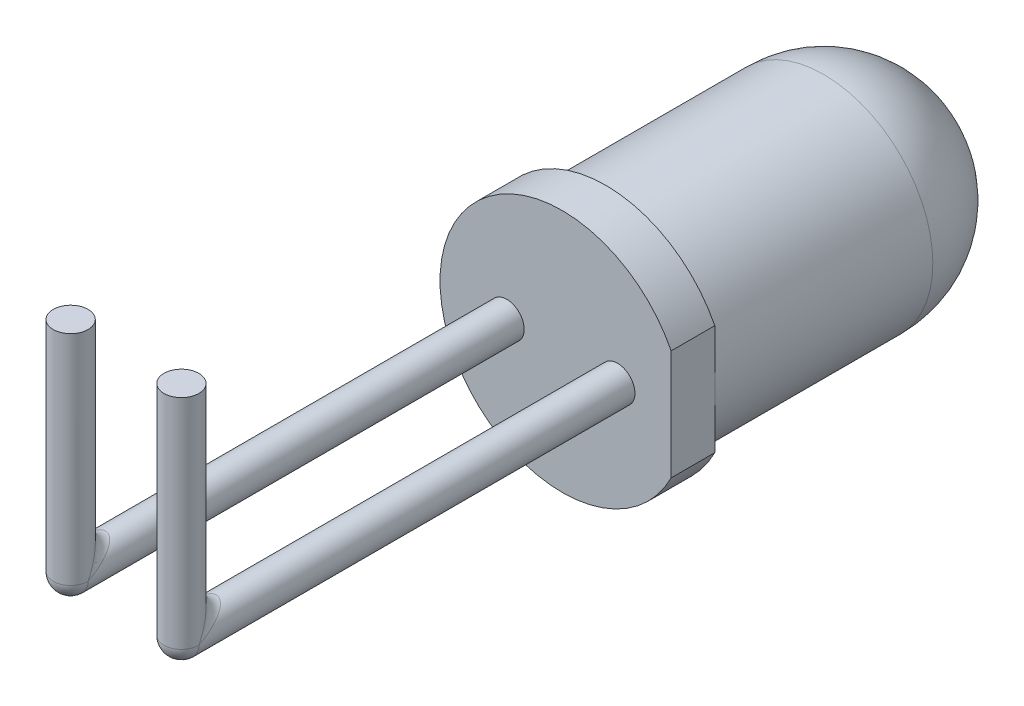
ISO-10303-21;
HEADER;
FILE_DESCRIPTION(('STEP AP214'),'2;1');
FILE_NAME('part.step','',(''),(''),'','','');
FILE_SCHEMA(('AUTOMOTIVE_DESIGN { 1 0 10303 214 1 1 1 1 }'));
ENDSEC;
DATA;
#1=APPLICATION_CONTEXT('core data for automotive mechanical design processes');
#2=APPLICATION_PROTOCOL_DEFINITION('international standard','automotive_design',2000,#1);
#3=PRODUCT_CONTEXT('',#1,'mechanical');
#4=PRODUCT('Part','Part','',(#3));
#5=PRODUCT_RELATED_PRODUCT_CATEGORY('part','',(#4));
#6=PRODUCT_DEFINITION_FORMATION('','',#4);
#7=PRODUCT_DEFINITION_CONTEXT('part definition',#1,'design');
#8=PRODUCT_DEFINITION('design','',#6,#7);
#9=PRODUCT_DEFINITION_SHAPE('','',#8);
#10=(LENGTH_UNIT() NAMED_UNIT(*) SI_UNIT(.MILLI.,.METRE.));
#11=(NAMED_UNIT(*) PLANE_ANGLE_UNIT() SI_UNIT($,.RADIAN.));
#12=(NAMED_UNIT(*) SI_UNIT($,.STERADIAN.) SOLID_ANGLE_UNIT());
#13=UNCERTAINTY_MEASURE_WITH_UNIT(LENGTH_MEASURE(1.E-05),#10,'distance_accuracy_value','');
#14=(GEOMETRIC_REPRESENTATION_CONTEXT(3) GLOBAL_UNCERTAINTY_ASSIGNED_CONTEXT((#13)) GLOBAL_UNIT_ASSIGNED_CONTEXT((#10,
#11,#12)) REPRESENTATION_CONTEXT('',''));
#15=CARTESIAN_POINT('',(0.,0.,0.));
#16=DIRECTION('',(0.,0.,1.));
#17=DIRECTION('',(1.,0.,0.));
#18=AXIS2_PLACEMENT_3D('',#15,#16,#17);
#19=CARTESIAN_POINT('',(0.,0.,8.5));
#20=DIRECTION('',(0.,0.,-1.));
#21=DIRECTION('',(-1.,0.,0.));
#22=AXIS2_PLACEMENT_3D('',#19,#20,#21);
#23=CYLINDRICAL_SURFACE('',#22,2.5);
#24=CARTESIAN_POINT('',(0.,0.,2.5));
#25=DIRECTION('',(0.,0.,-1.));
#26=DIRECTION('',(-1.,0.,0.));
#27=AXIS2_PLACEMENT_3D('',#24,#25,#26);
#28=CIRCLE('',#27,2.5);
#29=CARTESIAN_POINT('',(-2.5,0.,2.5));
#30=VERTEX_POINT('',#29);
#31=EDGE_CURVE('E99',#30,#30,#28,.F.);
#32=ORIENTED_EDGE('',*,*,#31,.T.);
#33=EDGE_LOOP('',(#32));
#34=FACE_BOUND('',#33,.T.);
#35=CARTESIAN_POINT('',(0.,0.,7.5));
#36=DIRECTION('',(0.,0.,1.));
#37=DIRECTION('',(1.,0.,0.));
#38=AXIS2_PLACEMENT_3D('',#35,#36,#37);
#39=CIRCLE('',#38,2.5);
#40=CARTESIAN_POINT('',(2.5,0.,7.5));
#41=VERTEX_POINT('',#40);
#42=EDGE_CURVE('E95',#41,#41,#39,.T.);
#43=ORIENTED_EDGE('',*,*,#42,.F.);
#44=EDGE_LOOP('',(#43));
#45=FACE_BOUND('',#44,.T.);
#46=ADVANCED_FACE('F28',(#34,#45),#23,.T.);
#47=CARTESIAN_POINT('',(0.,0.,7.5));
#48=DIRECTION('',(0.,0.,1.));
#49=DIRECTION('',(1.,0.,0.));
#50=AXIS2_PLACEMENT_3D('',#47,#48,#49);
#51=PLANE('',#50);
#52=DIRECTION('',(0.,1.,0.));
#53=VECTOR('',#52,1.);
#54=CARTESIAN_POINT('',(2.5,1.26095202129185,7.5));
#55=LINE('',#54,#53);
#56=CARTESIAN_POINT('',(2.5,1.26095202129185,7.5));
#57=VERTEX_POINT('',#56);
#58=EDGE_CURVE('E90',#41,#57,#55,.T.);
#59=ORIENTED_EDGE('',*,*,#58,.F.);
#60=ORIENTED_EDGE('',*,*,#42,.T.);
#61=CARTESIAN_POINT('',(2.5,-1.26095202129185,7.5));
#62=VERTEX_POINT('',#61);
#63=EDGE_CURVE('E80',#62,#41,#55,.T.);
#64=ORIENTED_EDGE('',*,*,#63,.F.);
#65=CARTESIAN_POINT('',(0.,0.,7.5));
#66=DIRECTION('',(0.,0.,1.));
#67=DIRECTION('',(1.,0.,0.));
#68=AXIS2_PLACEMENT_3D('',#65,#66,#67);
#69=CIRCLE('',#68,2.8);
#70=EDGE_CURVE('E74',#57,#62,#69,.T.);
#71=ORIENTED_EDGE('',*,*,#70,.F.);
#72=EDGE_LOOP('',(#59,#60,#64,#71));
#73=FACE_BOUND('',#72,.T.);
#74=ADVANCED_FACE('F140',(#73),#51,.F.);
#75=CARTESIAN_POINT('',(2.5,1.26095202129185,7.5));
#76=DIRECTION('',(1.,0.,0.));
#77=DIRECTION('',(0.,0.,-1.));
#78=AXIS2_PLACEMENT_3D('',#75,#76,#77);
#79=PLANE('',#78);
#80=ORIENTED_EDGE('',*,*,#63,.T.);
#81=ORIENTED_EDGE('',*,*,#58,.T.);
#82=DIRECTION('',(0.,0.,1.));
#83=VECTOR('',#82,1.);
#84=CARTESIAN_POINT('',(2.5,1.26095202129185,7.5));
#85=LINE('',#84,#83);
#86=CARTESIAN_POINT('',(2.5,1.26095202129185,8.5));
#87=VERTEX_POINT('',#86);
#88=EDGE_CURVE('E79',#57,#87,#85,.T.);
#89=ORIENTED_EDGE('',*,*,#88,.T.);
#90=DIRECTION('',(0.,1.,0.));
#91=VECTOR('',#90,1.);
#92=CARTESIAN_POINT('',(2.5,1.26095202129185,8.5));
#93=LINE('',#92,#91);
#94=CARTESIAN_POINT('',(2.5,-1.26095202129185,8.5));
#95=VERTEX_POINT('',#94);
#96=EDGE_CURVE('E84',#95,#87,#93,.T.);
#97=ORIENTED_EDGE('',*,*,#96,.F.);
#98=DIRECTION('',(0.,0.,1.));
#99=VECTOR('',#98,1.);
#100=CARTESIAN_POINT('',(2.5,-1.26095202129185,7.5));
#101=LINE('',#100,#99);
#102=EDGE_CURVE('E68',#62,#95,#101,.T.);
#103=ORIENTED_EDGE('',*,*,#102,.F.);
#104=EDGE_LOOP('',(#80,#81,#89,#97,#103));
#105=FACE_BOUND('',#104,.T.);
#106=ADVANCED_FACE('F88',(#105),#79,.T.);
#107=CARTESIAN_POINT('',(0.,0.,7.5));
#108=DIRECTION('',(0.,0.,1.));
#109=DIRECTION('',(1.,0.,0.));
#110=AXIS2_PLACEMENT_3D('',#107,#108,#109);
#111=CYLINDRICAL_SURFACE('',#110,2.8);
#112=CARTESIAN_POINT('',(0.,0.,8.5));
#113=DIRECTION('',(0.,0.,1.));
#114=DIRECTION('',(1.,0.,0.));
#115=AXIS2_PLACEMENT_3D('',#112,#113,#114);
#116=CIRCLE('',#115,2.8);
#117=EDGE_CURVE('E72',#87,#95,#116,.T.);
#118=ORIENTED_EDGE('',*,*,#117,.F.);
#119=ORIENTED_EDGE('',*,*,#88,.F.);
#120=ORIENTED_EDGE('',*,*,#70,.T.);
#121=ORIENTED_EDGE('',*,*,#102,.T.);
#122=EDGE_LOOP('',(#118,#119,#120,#121));
#123=FACE_BOUND('',#122,.T.);
#124=ADVANCED_FACE('F70',(#123),#111,.T.);
#125=CARTESIAN_POINT('',(0.,0.,8.5));
#126=DIRECTION('',(0.,0.,1.));
#127=DIRECTION('',(1.,0.,0.));
#128=AXIS2_PLACEMENT_3D('',#125,#126,#127);
#129=PLANE('',#128);
#130=CARTESIAN_POINT('',(-1.27,0.,8.5));
#131=DIRECTION('',(0.,0.,1.));
#132=DIRECTION('',(1.,0.,0.));
#133=AXIS2_PLACEMENT_3D('',#130,#131,#132);
#134=CIRCLE('',#133,0.4);
#135=CARTESIAN_POINT('',(-0.87,0.,8.5));
#136=VERTEX_POINT('',#135);
#137=EDGE_CURVE('E107',#136,#136,#134,.T.);
#138=ORIENTED_EDGE('',*,*,#137,.F.);
#139=EDGE_LOOP('',(#138));
#140=FACE_BOUND('',#139,.T.);
#141=CARTESIAN_POINT('',(1.27,0.,8.5));
#142=DIRECTION('',(0.,0.,1.));
#143=DIRECTION('',(1.,0.,0.));
#144=AXIS2_PLACEMENT_3D('',#141,#142,#143);
#145=CIRCLE('',#144,0.4);
#146=CARTESIAN_POINT('',(1.67,0.,8.5));
#147=VERTEX_POINT('',#146);
#148=EDGE_CURVE('E102',#147,#147,#145,.T.);
#149=ORIENTED_EDGE('',*,*,#148,.F.);
#150=EDGE_LOOP('',(#149));
#151=FACE_BOUND('',#150,.T.);
#152=ORIENTED_EDGE('',*,*,#96,.T.);
#153=ORIENTED_EDGE('',*,*,#117,.T.);
#154=EDGE_LOOP('',(#152,#153));
#155=FACE_BOUND('',#154,.T.);
#156=ADVANCED_FACE('F83',(#140,#151,#155),#129,.T.);
#157=CARTESIAN_POINT('',(0.,0.,2.5));
#158=DIRECTION('',(0.,0.,1.));
#159=DIRECTION('',(1.,0.,0.));
#160=AXIS2_PLACEMENT_3D('',#157,#158,#159);
#161=SPHERICAL_SURFACE('',#160,2.5);
#162=ORIENTED_EDGE('',*,*,#31,.F.);
#163=EDGE_LOOP('',(#162));
#164=FACE_BOUND('',#163,.T.);
#165=ADVANCED_FACE('F153',(#164),#161,.T.);
#166=CARTESIAN_POINT('',(1.27,0.,18.5));
#167=DIRECTION('',(0.,1.,0.));
#168=DIRECTION('',(0.,0.,1.));
#169=AXIS2_PLACEMENT_3D('',#166,#167,#168);
#170=CYLINDRICAL_SURFACE('',#169,0.4);
#171=CARTESIAN_POINT('',(1.27,0.,18.5));
#172=DIRECTION('',(0.,-0.447213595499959,-0.894427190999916));
#173=DIRECTION('',(0.,0.894427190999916,-0.447213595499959));
#174=AXIS2_PLACEMENT_3D('',#171,#172,#173);
#175=ELLIPSE('',#174,0.894427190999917,0.4);
#176=CARTESIAN_POINT('',(1.67,0.,18.5));
#177=VERTEX_POINT('',#176);
#178=CARTESIAN_POINT('',(0.87,0.,18.5));
#179=VERTEX_POINT('',#178);
#180=EDGE_CURVE('E103',#177,#179,#175,.F.);
#181=ORIENTED_EDGE('',*,*,#180,.T.);
#182=CARTESIAN_POINT('',(1.27,0.,18.5));
#183=DIRECTION('',(0.,1.,0.));
#184=DIRECTION('',(0.,0.,1.));
#185=AXIS2_PLACEMENT_3D('',#182,#183,#184);
#186=CIRCLE('',#185,0.4);
#187=EDGE_CURVE('E106',#179,#177,#186,.T.);
#188=ORIENTED_EDGE('',*,*,#187,.T.);
#189=EDGE_LOOP('',(#181,#188));
#190=FACE_BOUND('',#189,.T.);
#191=CARTESIAN_POINT('',(1.27,5.,18.5));
#192=DIRECTION('',(0.,1.,0.));
#193=DIRECTION('',(0.,0.,1.));
#194=AXIS2_PLACEMENT_3D('',#191,#192,#193);
#195=CIRCLE('',#194,0.4);
#196=CARTESIAN_POINT('',(1.27,5.,18.9));
#197=VERTEX_POINT('',#196);
#198=EDGE_CURVE('E86',#197,#197,#195,.F.);
#199=ORIENTED_EDGE('',*,*,#198,.T.);
#200=EDGE_LOOP('',(#199));
#201=FACE_BOUND('',#200,.T.);
#202=ADVANCED_FACE('F154',(#190,#201),#170,.T.);
#203=CARTESIAN_POINT('',(1.27,0.,19.6313708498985));
#204=DIRECTION('',(0.,0.,-1.));
#205=DIRECTION('',(0.,1.,0.));
#206=AXIS2_PLACEMENT_3D('',#203,#204,#205);
#207=CYLINDRICAL_SURFACE('',#206,0.4);
#208=ORIENTED_EDGE('',*,*,#148,.T.);
#209=EDGE_LOOP('',(#208));
#210=FACE_BOUND('',#209,.T.);
#211=CARTESIAN_POINT('',(1.27,0.,18.5));
#212=DIRECTION('',(0.,0.,-1.));
#213=DIRECTION('',(0.,1.,0.));
#214=AXIS2_PLACEMENT_3D('',#211,#212,#213);
#215=CIRCLE('',#214,0.4);
#216=EDGE_CURVE('E110',#177,#179,#215,.T.);
#217=ORIENTED_EDGE('',*,*,#216,.T.);
#218=CARTESIAN_POINT('',(1.27,0.,18.5));
#219=DIRECTION('',(0.,-0.894427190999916,-0.447213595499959));
#220=DIRECTION('',(0.,0.447213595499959,-0.894427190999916));
#221=AXIS2_PLACEMENT_3D('',#218,#219,#220);
#222=ELLIPSE('',#221,0.894427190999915,0.4);
#223=EDGE_CURVE('E113',#179,#177,#222,.T.);
#224=ORIENTED_EDGE('',*,*,#223,.T.);
#225=EDGE_LOOP('',(#217,#224));
#226=FACE_BOUND('',#225,.T.);
#227=ADVANCED_FACE('F160',(#210,#226),#207,.T.);
#228=CARTESIAN_POINT('',(1.27,5.,18.5));
#229=DIRECTION('',(0.,1.,0.));
#230=DIRECTION('',(0.,0.,1.));
#231=AXIS2_PLACEMENT_3D('',#228,#229,#230);
#232=PLANE('',#231);
#233=ORIENTED_EDGE('',*,*,#198,.F.);
#234=EDGE_LOOP('',(#233));
#235=FACE_BOUND('',#234,.T.);
#236=ADVANCED_FACE('F203',(#235),#232,.T.);
#237=CARTESIAN_POINT('',(-1.27,0.,18.5));
#238=DIRECTION('',(0.,1.,0.));
#239=DIRECTION('',(0.,0.,1.));
#240=AXIS2_PLACEMENT_3D('',#237,#238,#239);
#241=CYLINDRICAL_SURFACE('',#240,0.4);
#242=CARTESIAN_POINT('',(-1.27,0.,18.5));
#243=DIRECTION('',(0.,-0.447213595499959,-0.894427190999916));
#244=DIRECTION('',(0.,0.894427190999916,-0.447213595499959));
#245=AXIS2_PLACEMENT_3D('',#242,#243,#244);
#246=ELLIPSE('',#245,0.894427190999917,0.4);
#247=CARTESIAN_POINT('',(-0.87,0.,18.5));
#248=VERTEX_POINT('',#247);
#249=CARTESIAN_POINT('',(-1.67,0.,18.5));
#250=VERTEX_POINT('',#249);
#251=EDGE_CURVE('E116',#248,#250,#246,.F.);
#252=ORIENTED_EDGE('',*,*,#251,.T.);
#253=CARTESIAN_POINT('',(-1.27,0.,18.5));
#254=DIRECTION('',(0.,1.,0.));
#255=DIRECTION('',(0.,0.,1.));
#256=AXIS2_PLACEMENT_3D('',#253,#254,#255);
#257=CIRCLE('',#256,0.4);
#258=EDGE_CURVE('E119',#250,#248,#257,.T.);
#259=ORIENTED_EDGE('',*,*,#258,.T.);
#260=EDGE_LOOP('',(#252,#259));
#261=FACE_BOUND('',#260,.T.);
#262=CARTESIAN_POINT('',(-1.27,5.,18.5));
#263=DIRECTION('',(0.,1.,0.));
#264=DIRECTION('',(0.,0.,1.));
#265=AXIS2_PLACEMENT_3D('',#262,#263,#264);
#266=CIRCLE('',#265,0.4);
#267=CARTESIAN_POINT('',(-1.27,5.,18.9));
#268=VERTEX_POINT('',#267);
#269=EDGE_CURVE('E262',#268,#268,#266,.F.);
#270=ORIENTED_EDGE('',*,*,#269,.T.);
#271=EDGE_LOOP('',(#270));
#272=FACE_BOUND('',#271,.T.);
#273=ADVANCED_FACE('F124',(#261,#272),#241,.T.);
#274=CARTESIAN_POINT('',(-1.27,0.,19.6313708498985));
#275=DIRECTION('',(0.,0.,-1.));
#276=DIRECTION('',(0.,1.,0.));
#277=AXIS2_PLACEMENT_3D('',#274,#275,#276);
#278=CYLINDRICAL_SURFACE('',#277,0.4);
#279=ORIENTED_EDGE('',*,*,#137,.T.);
#280=EDGE_LOOP('',(#279));
#281=FACE_BOUND('',#280,.T.);
#282=CARTESIAN_POINT('',(-1.27,0.,18.5));
#283=DIRECTION('',(0.,0.,-1.));
#284=DIRECTION('',(0.,1.,0.));
#285=AXIS2_PLACEMENT_3D('',#282,#283,#284);
#286=CIRCLE('',#285,0.4);
#287=EDGE_CURVE('E35',#248,#250,#286,.T.);
#288=ORIENTED_EDGE('',*,*,#287,.T.);
#289=CARTESIAN_POINT('',(-1.27,0.,18.5));
#290=DIRECTION('',(0.,-0.894427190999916,-0.447213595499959));
#291=DIRECTION('',(0.,0.447213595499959,-0.894427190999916));
#292=AXIS2_PLACEMENT_3D('',#289,#290,#291);
#293=ELLIPSE('',#292,0.894427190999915,0.4);
#294=EDGE_CURVE('E12',#250,#248,#293,.T.);
#295=ORIENTED_EDGE('',*,*,#294,.T.);
#296=EDGE_LOOP('',(#288,#295));
#297=FACE_BOUND('',#296,.T.);
#298=ADVANCED_FACE('F122',(#281,#297),#278,.T.);
#299=CARTESIAN_POINT('',(-1.27,5.,18.5));
#300=DIRECTION('',(0.,1.,0.));
#301=DIRECTION('',(0.,0.,1.));
#302=AXIS2_PLACEMENT_3D('',#299,#300,#301);
#303=PLANE('',#302);
#304=ORIENTED_EDGE('',*,*,#269,.F.);
#305=EDGE_LOOP('',(#304));
#306=FACE_BOUND('',#305,.T.);
#307=ADVANCED_FACE('F222',(#306),#303,.T.);
#308=CARTESIAN_POINT('',(1.27,0.,18.5));
#309=DIRECTION('',(0.,0.,1.));
#310=DIRECTION('',(1.,0.,0.));
#311=AXIS2_PLACEMENT_3D('',#308,#309,#310);
#312=SPHERICAL_SURFACE('',#311,0.4);
#313=ORIENTED_EDGE('',*,*,#187,.F.);
#314=ORIENTED_EDGE('',*,*,#216,.F.);
#315=EDGE_LOOP('',(#313,#314));
#316=FACE_BOUND('',#315,.T.);
#317=ADVANCED_FACE('F136',(#316),#312,.T.);
#318=CARTESIAN_POINT('',(1.67,0.,18.5));
#319=CARTESIAN_POINT('',(1.67,0.,18.5));
#320=CARTESIAN_POINT('',(1.67,0.,18.5));
#321=CARTESIAN_POINT('',(1.66999298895,0.0348517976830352,18.4825741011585));
#322=CARTESIAN_POINT('',(1.67005108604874,0.0261441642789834,18.473855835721));
#323=CARTESIAN_POINT('',(1.66999298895,0.0174258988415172,18.465148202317));
#324=CARTESIAN_POINT('',(1.66886070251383,0.0697124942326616,18.4651437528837));
#325=CARTESIAN_POINT('',(1.66772093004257,0.0523600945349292,18.4476399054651));
#326=CARTESIAN_POINT('',(1.66886070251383,0.0348562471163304,18.4302875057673));
#327=CARTESIAN_POINT('',(1.66431458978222,0.138834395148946,18.4305828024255));
#328=CARTESIAN_POINT('',(1.65863330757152,0.103749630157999,18.396250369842));
#329=CARTESIAN_POINT('',(1.66431458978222,0.0694171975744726,18.3611656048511));
#330=CARTESIAN_POINT('',(1.66092023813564,0.173098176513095,18.4134509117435));
#331=CARTESIAN_POINT('',(1.65186272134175,0.129071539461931,18.3709284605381));
#332=CARTESIAN_POINT('',(1.66092023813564,0.0865490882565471,18.3269018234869));
#333=CARTESIAN_POINT('',(1.65189673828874,0.24044273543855,18.3797786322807));
#334=CARTESIAN_POINT('',(1.63414910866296,0.177786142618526,18.3222138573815));
#335=CARTESIAN_POINT('',(1.65189673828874,0.120221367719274,18.2595572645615));
#336=CARTESIAN_POINT('',(1.6463060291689,0.273533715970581,18.3632331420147));
#337=CARTESIAN_POINT('',(1.62318021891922,0.201325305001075,18.2986746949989));
#338=CARTESIAN_POINT('',(1.6463060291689,0.13676685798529,18.2264662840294));
#339=CARTESIAN_POINT('',(1.63296398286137,0.337956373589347,18.3310218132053));
#340=CARTESIAN_POINT('',(1.59763412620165,0.245616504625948,18.2543834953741));
#341=CARTESIAN_POINT('',(1.63296398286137,0.168978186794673,18.1620436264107));
#342=CARTESIAN_POINT('',(1.62526926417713,0.369311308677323,18.3153443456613));
#343=CARTESIAN_POINT('',(1.58301825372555,0.266510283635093,18.2334897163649));
#344=CARTESIAN_POINT('',(1.62526926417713,0.184655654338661,18.1306886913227));
#345=CARTESIAN_POINT('',(1.60783304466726,0.429711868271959,18.285144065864));
#346=CARTESIAN_POINT('',(1.55100028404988,0.304712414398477,18.1952875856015));
#347=CARTESIAN_POINT('',(1.60783304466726,0.214855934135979,18.070288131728));
#348=CARTESIAN_POINT('',(1.59816448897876,0.458799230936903,18.2706003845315));
#349=CARTESIAN_POINT('',(1.53354818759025,0.32215419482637,18.1778458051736));
#350=CARTESIAN_POINT('',(1.59816448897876,0.229399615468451,18.0412007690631));
#351=CARTESIAN_POINT('',(1.57692939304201,0.514147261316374,18.2429263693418));
#352=CARTESIAN_POINT('',(1.49701863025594,0.352779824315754,18.1472201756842));
#353=CARTESIAN_POINT('',(1.57692939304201,0.257073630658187,17.9858527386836));
#354=CARTESIAN_POINT('',(1.56544892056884,0.540473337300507,18.2297633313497));
#355=CARTESIAN_POINT('',(1.47788315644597,0.366083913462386,18.1339160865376));
#356=CARTESIAN_POINT('',(1.56544892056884,0.270236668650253,17.9595266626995));
#357=CARTESIAN_POINT('',(1.54077355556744,0.589823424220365,18.2050882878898));
#358=CARTESIAN_POINT('',(1.43951787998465,0.388004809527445,18.1119951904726));
#359=CARTESIAN_POINT('',(1.54077355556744,0.294911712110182,17.9101765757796));
#360=CARTESIAN_POINT('',(1.52767253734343,0.612940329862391,18.1935298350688));
#361=CARTESIAN_POINT('',(1.42022816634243,0.396723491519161,18.1032765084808));
#362=CARTESIAN_POINT('',(1.52767253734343,0.306470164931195,17.8870596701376));
#363=CARTESIAN_POINT('',(1.49997342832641,0.655447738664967,18.1722761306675));
#364=CARTESIAN_POINT('',(1.38341468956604,0.409472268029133,18.0905277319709));
#365=CARTESIAN_POINT('',(1.49997342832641,0.327723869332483,17.844552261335));
#366=CARTESIAN_POINT('',(1.48546909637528,0.674959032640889,18.1625204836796));
#367=CARTESIAN_POINT('',(1.36583761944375,0.413582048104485,18.0864179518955));
#368=CARTESIAN_POINT('',(1.48546909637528,0.337479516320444,17.8250409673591));
#369=CARTESIAN_POINT('',(1.45521408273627,0.709892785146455,18.1450536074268));
#370=CARTESIAN_POINT('',(1.33439698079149,0.417771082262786,18.0822289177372));
#371=CARTESIAN_POINT('',(1.45521408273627,0.354946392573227,17.7901072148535));
#372=CARTESIAN_POINT('',(1.43954673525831,0.725457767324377,18.1372711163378));
#373=CARTESIAN_POINT('',(1.32049509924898,0.417907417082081,18.0820925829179));
#374=CARTESIAN_POINT('',(1.43954673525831,0.362728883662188,17.7745422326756));
#375=CARTESIAN_POINT('',(1.40724861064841,0.752212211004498,18.1238938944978));
#376=CARTESIAN_POINT('',(1.2978686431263,0.41562409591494,18.0843759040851));
#377=CARTESIAN_POINT('',(1.40724861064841,0.376106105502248,17.7477877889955));
#378=CARTESIAN_POINT('',(1.39068005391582,0.763549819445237,18.1182250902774));
#379=CARTESIAN_POINT('',(1.28912434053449,0.413242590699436,18.0867574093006));
#380=CARTESIAN_POINT('',(1.39068005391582,0.381774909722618,17.7364501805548));
#381=CARTESIAN_POINT('',(1.35689020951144,0.781655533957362,18.1091722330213));
#382=CARTESIAN_POINT('',(1.2769352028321,0.408038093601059,18.0919619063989));
#383=CARTESIAN_POINT('',(1.35689020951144,0.390827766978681,17.7183444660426));
#384=CARTESIAN_POINT('',(1.33970345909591,0.788550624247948,18.105724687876));
#385=CARTESIAN_POINT('',(1.27348474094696,0.405239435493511,18.0947605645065));
#386=CARTESIAN_POINT('',(1.33970345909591,0.394275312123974,17.7114493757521));
#387=CARTESIAN_POINT('',(1.30500449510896,0.797685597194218,18.1011572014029));
#388=CARTESIAN_POINT('',(1.27002308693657,0.401214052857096,18.0987859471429));
#389=CARTESIAN_POINT('',(1.30500449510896,0.398842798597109,17.7023144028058));
#390=CARTESIAN_POINT('',(1.28750224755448,0.799999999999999,18.1));
#391=CARTESIAN_POINT('',(1.27001157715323,0.399999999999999,18.1));
#392=CARTESIAN_POINT('',(1.28750224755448,0.399999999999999,17.7));
#393=CARTESIAN_POINT('',(1.25249775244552,0.799999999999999,18.1));
#394=CARTESIAN_POINT('',(1.26998842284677,0.399999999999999,18.1));
#395=CARTESIAN_POINT('',(1.25249775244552,0.399999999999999,17.7));
#396=CARTESIAN_POINT('',(1.23499550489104,0.797685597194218,18.1011572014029));
#397=CARTESIAN_POINT('',(1.26997691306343,0.401214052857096,18.0987859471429));
#398=CARTESIAN_POINT('',(1.23499550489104,0.398842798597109,17.7023144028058));
#399=CARTESIAN_POINT('',(1.20029654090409,0.788550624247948,18.105724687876));
#400=CARTESIAN_POINT('',(1.26651525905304,0.405239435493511,18.0947605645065));
#401=CARTESIAN_POINT('',(1.20029654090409,0.394275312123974,17.7114493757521));
#402=CARTESIAN_POINT('',(1.18310979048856,0.781655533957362,18.1091722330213));
#403=CARTESIAN_POINT('',(1.2630647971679,0.408038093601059,18.0919619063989));
#404=CARTESIAN_POINT('',(1.18310979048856,0.390827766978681,17.7183444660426));
#405=CARTESIAN_POINT('',(1.14931994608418,0.763549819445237,18.1182250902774));
#406=CARTESIAN_POINT('',(1.25087565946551,0.413242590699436,18.0867574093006));
#407=CARTESIAN_POINT('',(1.14931994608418,0.381774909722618,17.7364501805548));
#408=CARTESIAN_POINT('',(1.13275138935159,0.752212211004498,18.1238938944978));
#409=CARTESIAN_POINT('',(1.2421313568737,0.41562409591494,18.0843759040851));
#410=CARTESIAN_POINT('',(1.13275138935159,0.376106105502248,17.7477877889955));
#411=CARTESIAN_POINT('',(1.10045326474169,0.725457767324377,18.1372711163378));
#412=CARTESIAN_POINT('',(1.21950490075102,0.417907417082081,18.0820925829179));
#413=CARTESIAN_POINT('',(1.10045326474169,0.362728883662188,17.7745422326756));
#414=CARTESIAN_POINT('',(1.08478591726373,0.709892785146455,18.1450536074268));
#415=CARTESIAN_POINT('',(1.20560301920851,0.417771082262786,18.0822289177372));
#416=CARTESIAN_POINT('',(1.08478591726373,0.354946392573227,17.7901072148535));
#417=CARTESIAN_POINT('',(1.05453090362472,0.674959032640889,18.1625204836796));
#418=CARTESIAN_POINT('',(1.17416238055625,0.413582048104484,18.0864179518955));
#419=CARTESIAN_POINT('',(1.05453090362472,0.337479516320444,17.8250409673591));
#420=CARTESIAN_POINT('',(1.04002657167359,0.655447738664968,18.1722761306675));
#421=CARTESIAN_POINT('',(1.15658531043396,0.409472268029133,18.0905277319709));
#422=CARTESIAN_POINT('',(1.04002657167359,0.327723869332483,17.844552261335));
#423=CARTESIAN_POINT('',(1.01232746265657,0.612940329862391,18.1935298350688));
#424=CARTESIAN_POINT('',(1.11977183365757,0.396723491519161,18.1032765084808));
#425=CARTESIAN_POINT('',(1.01232746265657,0.306470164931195,17.8870596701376));
#426=CARTESIAN_POINT('',(0.999226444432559,0.589823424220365,18.2050882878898));
#427=CARTESIAN_POINT('',(1.10048212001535,0.388004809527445,18.1119951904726));
#428=CARTESIAN_POINT('',(0.999226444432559,0.294911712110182,17.9101765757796));
#429=CARTESIAN_POINT('',(0.974551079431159,0.540473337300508,18.2297633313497));
#430=CARTESIAN_POINT('',(1.06211684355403,0.366083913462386,18.1339160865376));
#431=CARTESIAN_POINT('',(0.974551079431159,0.270236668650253,17.9595266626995));
#432=CARTESIAN_POINT('',(0.96307060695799,0.514147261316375,18.2429263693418));
#433=CARTESIAN_POINT('',(1.04298136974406,0.352779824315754,18.1472201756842));
#434=CARTESIAN_POINT('',(0.963070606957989,0.257073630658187,17.9858527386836));
#435=CARTESIAN_POINT('',(0.941835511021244,0.458799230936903,18.2706003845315));
#436=CARTESIAN_POINT('',(1.00645181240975,0.32215419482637,18.1778458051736));
#437=CARTESIAN_POINT('',(0.941835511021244,0.229399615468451,18.0412007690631));
#438=CARTESIAN_POINT('',(0.932166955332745,0.429711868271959,18.285144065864));
#439=CARTESIAN_POINT('',(0.988999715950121,0.304712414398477,18.1952875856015));
#440=CARTESIAN_POINT('',(0.932166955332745,0.214855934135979,18.070288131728));
#441=CARTESIAN_POINT('',(0.91473073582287,0.369311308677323,18.3153443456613));
#442=CARTESIAN_POINT('',(0.956981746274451,0.266510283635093,18.2334897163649));
#443=CARTESIAN_POINT('',(0.91473073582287,0.184655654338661,18.1306886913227));
#444=CARTESIAN_POINT('',(0.907036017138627,0.337956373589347,18.3310218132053));
#445=CARTESIAN_POINT('',(0.942365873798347,0.245616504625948,18.2543834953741));
#446=CARTESIAN_POINT('',(0.907036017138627,0.168978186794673,18.1620436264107));
#447=CARTESIAN_POINT('',(0.893693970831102,0.273533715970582,18.3632331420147));
#448=CARTESIAN_POINT('',(0.916819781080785,0.201325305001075,18.2986746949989));
#449=CARTESIAN_POINT('',(0.893693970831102,0.13676685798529,18.2264662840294));
#450=CARTESIAN_POINT('',(0.888103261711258,0.24044273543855,18.3797786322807));
#451=CARTESIAN_POINT('',(0.905850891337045,0.177786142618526,18.3222138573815));
#452=CARTESIAN_POINT('',(0.888103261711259,0.120221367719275,18.2595572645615));
#453=CARTESIAN_POINT('',(0.879079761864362,0.173098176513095,18.4134509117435));
#454=CARTESIAN_POINT('',(0.888137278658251,0.129071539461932,18.3709284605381));
#455=CARTESIAN_POINT('',(0.879079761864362,0.0865490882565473,18.3269018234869));
#456=CARTESIAN_POINT('',(0.87568541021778,0.138834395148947,18.4305828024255));
#457=CARTESIAN_POINT('',(0.881366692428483,0.103749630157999,18.396250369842));
#458=CARTESIAN_POINT('',(0.87568541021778,0.0694171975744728,18.3611656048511));
#459=CARTESIAN_POINT('',(0.871139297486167,0.069712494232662,18.4651437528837));
#460=CARTESIAN_POINT('',(0.872279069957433,0.0523600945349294,18.4476399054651));
#461=CARTESIAN_POINT('',(0.871139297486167,0.0348562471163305,18.4302875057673));
#462=CARTESIAN_POINT('',(0.870007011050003,0.0348517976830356,18.4825741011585));
#463=CARTESIAN_POINT('',(0.869948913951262,0.0261441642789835,18.473855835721));
#464=CARTESIAN_POINT('',(0.870007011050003,0.0174258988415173,18.465148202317));
#465=CARTESIAN_POINT('',(0.87,0.,18.5));
#466=CARTESIAN_POINT('',(0.87,0.,18.5));
#467=CARTESIAN_POINT('',(0.87,0.,18.5));
#468=(BOUNDED_SURFACE() B_SPLINE_SURFACE(3,2,((#318,#319,#320),(#321,#322,#323),(#324,#325,
#326),(#327,#328,#329),(#330,#331,#332),(#333,#334,#335),(#336,#337,#338),(#339,#340,#341),
(#342,#343,#344),(#345,#346,#347),(#348,#349,#350),(#351,#352,#353),(#354,#355,#356),(#357,#358,
#359),(#360,#361,#362),(#363,#364,#365),(#366,#367,#368),(#369,#370,#371),(#372,#373,#374),
(#375,#376,#377),(#378,#379,#380),(#381,#382,#383),(#384,#385,#386),(#387,#388,#389),(#390,#391,
#392),(#393,#394,#395),(#396,#397,#398),(#399,#400,#401),(#402,#403,#404),(#405,#406,#407),
(#408,#409,#410),(#411,#412,#413),(#414,#415,#416),(#417,#418,#419),(#420,#421,#422),(#423,#424,
#425),(#426,#427,#428),(#429,#430,#431),(#432,#433,#434),(#435,#436,#437),(#438,#439,#440),
(#441,#442,#443),(#444,#445,#446),(#447,#448,#449),(#450,#451,#452),(#453,#454,#455),(#456,#457,
#458),(#459,#460,#461),(#462,#463,#464),(#465,#466,#467)),.UNSPECIFIED.,.F.,.F.,
.F.) B_SPLINE_SURFACE_WITH_KNOTS((4,2,2,2,2,2,2,2,2,2,2,2,2,2,2,2,2,2,2,2,2,2,2,2,4),(3,3),(0.,
0.147832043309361,0.294407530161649,0.438524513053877,0.579091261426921,0.715183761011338,
0.846105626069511,0.971449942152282,1.09116027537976,1.2055837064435,1.31550198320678,
1.42211980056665,1.52698838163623,1.63185696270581,1.73847478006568,1.84839305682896,
1.9628164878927,2.08252682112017,2.20787113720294,2.33879300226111,2.47488550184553,
2.61545225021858,2.7595692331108,2.90614471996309,3.05397676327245),(0.,1.),
.UNSPECIFIED.) GEOMETRIC_REPRESENTATION_ITEM() RATIONAL_B_SPLINE_SURFACE(((1.,1.,1.),(1.,
1.00000566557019,1.),(1.,0.998576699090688,1.),(1.,0.992910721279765,1.),(1.,0.988697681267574,
1.),(1.,0.977617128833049,1.),(1.,0.970795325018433,1.),(1.,0.954789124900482,1.),(1.,
0.94566706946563,1.),(1.,0.925487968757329,1.),(1.,0.914501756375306,1.),(1.,0.891169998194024,
1.),(1.,0.878891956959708,1.),(1.,0.853706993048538,1.),(1.,0.84084914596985,1.),(1.,
0.815387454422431,1.),(1.,0.802798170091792,1.),(1.,0.778880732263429,1.),(1.,0.767521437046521,
1.),(1.,0.747118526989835,1.),(1.,0.738001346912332,1.),(1.,0.723039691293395,1.),(1.,
0.717105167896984,1.),(1.,0.709170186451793,1.),(1.,0.707106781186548,1.),(1.,0.707106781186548,
1.),(1.,0.709170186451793,1.),(1.,0.717105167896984,1.),(1.,0.723039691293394,1.),(1.,
0.738001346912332,1.),(1.,0.747118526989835,1.),(1.,0.767521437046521,1.),(1.,0.778880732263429,
1.),(1.,0.802798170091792,1.),(1.,0.815387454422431,1.),(1.,0.84084914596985,1.),(1.,
0.853706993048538,1.),(1.,0.878891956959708,1.),(1.,0.891169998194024,1.),(1.,0.914501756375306,
1.),(1.,0.925487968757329,1.),(1.,0.94566706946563,1.),(1.,0.954789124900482,1.),(1.,
0.970795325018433,1.),(1.,0.97761712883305,1.),(1.,0.988697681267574,1.),(1.,0.992910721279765,
1.),(1.,0.998576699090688,1.),(1.,1.00000566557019,1.),(1.,1.,1.))) REPRESENTATION_ITEM('') SURFACE());
#469=ORIENTED_EDGE('',*,*,#180,.F.);
#470=ORIENTED_EDGE('',*,*,#223,.F.);
#471=EDGE_LOOP('',(#469,#470));
#472=FACE_BOUND('',#471,.T.);
#473=ADVANCED_FACE('F129',(#472),#468,.F.);
#474=CARTESIAN_POINT('',(-1.27,0.,18.5));
#475=DIRECTION('',(0.,0.,1.));
#476=DIRECTION('',(1.,0.,0.));
#477=AXIS2_PLACEMENT_3D('',#474,#475,#476);
#478=SPHERICAL_SURFACE('',#477,0.4);
#479=ORIENTED_EDGE('',*,*,#258,.F.);
#480=ORIENTED_EDGE('',*,*,#287,.F.);
#481=EDGE_LOOP('',(#479,#480));
#482=FACE_BOUND('',#481,.T.);
#483=ADVANCED_FACE('F126',(#482),#478,.T.);
#484=CARTESIAN_POINT('',(-0.87,0.,18.5));
#485=CARTESIAN_POINT('',(-0.87,0.,18.5));
#486=CARTESIAN_POINT('',(-0.87,0.,18.5));
#487=CARTESIAN_POINT('',(-0.870007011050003,0.034851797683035,18.4825741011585));
#488=CARTESIAN_POINT('',(-0.869948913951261,0.026144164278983,18.473855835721));
#489=CARTESIAN_POINT('',(-0.870007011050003,0.0174258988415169,18.465148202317));
#490=CARTESIAN_POINT('',(-0.871139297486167,0.0697124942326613,18.4651437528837));
#491=CARTESIAN_POINT('',(-0.872279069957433,0.0523600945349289,18.4476399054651));
#492=CARTESIAN_POINT('',(-0.871139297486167,0.03485624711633,18.4302875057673));
#493=CARTESIAN_POINT('',(-0.87568541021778,0.138834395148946,18.4305828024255));
#494=CARTESIAN_POINT('',(-0.881366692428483,0.103749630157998,18.396250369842));
#495=CARTESIAN_POINT('',(-0.875685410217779,0.0694171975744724,18.3611656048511));
#496=CARTESIAN_POINT('',(-0.879079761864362,0.173098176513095,18.4134509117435));
#497=CARTESIAN_POINT('',(-0.88813727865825,0.129071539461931,18.3709284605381));
#498=CARTESIAN_POINT('',(-0.879079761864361,0.0865490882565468,18.3269018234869));
#499=CARTESIAN_POINT('',(-0.888103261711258,0.240442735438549,18.3797786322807));
#500=CARTESIAN_POINT('',(-0.905850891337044,0.177786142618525,18.3222138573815));
#501=CARTESIAN_POINT('',(-0.888103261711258,0.120221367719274,18.2595572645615));
#502=CARTESIAN_POINT('',(-0.893693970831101,0.273533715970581,18.3632331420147));
#503=CARTESIAN_POINT('',(-0.916819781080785,0.201325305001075,18.2986746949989));
#504=CARTESIAN_POINT('',(-0.893693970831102,0.13676685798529,18.2264662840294));
#505=CARTESIAN_POINT('',(-0.907036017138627,0.337956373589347,18.3310218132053));
#506=CARTESIAN_POINT('',(-0.942365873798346,0.245616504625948,18.2543834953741));
#507=CARTESIAN_POINT('',(-0.907036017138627,0.168978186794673,18.1620436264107));
#508=CARTESIAN_POINT('',(-0.914730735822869,0.369311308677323,18.3153443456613));
#509=CARTESIAN_POINT('',(-0.956981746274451,0.266510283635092,18.2334897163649));
#510=CARTESIAN_POINT('',(-0.914730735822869,0.184655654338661,18.1306886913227));
#511=CARTESIAN_POINT('',(-0.932166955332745,0.429711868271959,18.285144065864));
#512=CARTESIAN_POINT('',(-0.98899971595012,0.304712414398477,18.1952875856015));
#513=CARTESIAN_POINT('',(-0.932166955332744,0.214855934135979,18.070288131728));
#514=CARTESIAN_POINT('',(-0.941835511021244,0.458799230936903,18.2706003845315));
#515=CARTESIAN_POINT('',(-1.00645181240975,0.322154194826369,18.1778458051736));
#516=CARTESIAN_POINT('',(-0.941835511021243,0.229399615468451,18.0412007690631));
#517=CARTESIAN_POINT('',(-0.963070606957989,0.514147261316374,18.2429263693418));
#518=CARTESIAN_POINT('',(-1.04298136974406,0.352779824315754,18.1472201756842));
#519=CARTESIAN_POINT('',(-0.963070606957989,0.257073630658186,17.9858527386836));
#520=CARTESIAN_POINT('',(-0.974551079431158,0.540473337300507,18.2297633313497));
#521=CARTESIAN_POINT('',(-1.06211684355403,0.366083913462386,18.1339160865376));
#522=CARTESIAN_POINT('',(-0.974551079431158,0.270236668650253,17.9595266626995));
#523=CARTESIAN_POINT('',(-0.999226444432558,0.589823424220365,18.2050882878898));
#524=CARTESIAN_POINT('',(-1.10048212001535,0.388004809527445,18.1119951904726));
#525=CARTESIAN_POINT('',(-0.999226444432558,0.294911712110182,17.9101765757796));
#526=CARTESIAN_POINT('',(-1.01232746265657,0.612940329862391,18.1935298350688));
#527=CARTESIAN_POINT('',(-1.11977183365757,0.396723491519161,18.1032765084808));
#528=CARTESIAN_POINT('',(-1.01232746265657,0.306470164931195,17.8870596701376));
#529=CARTESIAN_POINT('',(-1.04002657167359,0.655447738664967,18.1722761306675));
#530=CARTESIAN_POINT('',(-1.15658531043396,0.409472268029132,18.0905277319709));
#531=CARTESIAN_POINT('',(-1.04002657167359,0.327723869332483,17.844552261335));
#532=CARTESIAN_POINT('',(-1.05453090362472,0.674959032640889,18.1625204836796));
#533=CARTESIAN_POINT('',(-1.17416238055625,0.413582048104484,18.0864179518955));
#534=CARTESIAN_POINT('',(-1.05453090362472,0.337479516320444,17.8250409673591));
#535=CARTESIAN_POINT('',(-1.08478591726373,0.709892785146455,18.1450536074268));
#536=CARTESIAN_POINT('',(-1.20560301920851,0.417771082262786,18.0822289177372));
#537=CARTESIAN_POINT('',(-1.08478591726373,0.354946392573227,17.7901072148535));
#538=CARTESIAN_POINT('',(-1.10045326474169,0.725457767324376,18.1372711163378));
#539=CARTESIAN_POINT('',(-1.21950490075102,0.417907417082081,18.0820925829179));
#540=CARTESIAN_POINT('',(-1.10045326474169,0.362728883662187,17.7745422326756));
#541=CARTESIAN_POINT('',(-1.13275138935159,0.752212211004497,18.1238938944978));
#542=CARTESIAN_POINT('',(-1.2421313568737,0.415624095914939,18.0843759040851));
#543=CARTESIAN_POINT('',(-1.13275138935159,0.376106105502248,17.7477877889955));
#544=CARTESIAN_POINT('',(-1.14931994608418,0.763549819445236,18.1182250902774));
#545=CARTESIAN_POINT('',(-1.25087565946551,0.413242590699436,18.0867574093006));
#546=CARTESIAN_POINT('',(-1.14931994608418,0.381774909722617,17.7364501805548));
#547=CARTESIAN_POINT('',(-1.18310979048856,0.781655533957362,18.1091722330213));
#548=CARTESIAN_POINT('',(-1.2630647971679,0.408038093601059,18.0919619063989));
#549=CARTESIAN_POINT('',(-1.18310979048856,0.39082776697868,17.7183444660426));
#550=CARTESIAN_POINT('',(-1.20029654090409,0.788550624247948,18.105724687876));
#551=CARTESIAN_POINT('',(-1.26651525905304,0.405239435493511,18.0947605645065));
#552=CARTESIAN_POINT('',(-1.20029654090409,0.394275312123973,17.7114493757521));
#553=CARTESIAN_POINT('',(-1.23499550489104,0.797685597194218,18.1011572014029));
#554=CARTESIAN_POINT('',(-1.26997691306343,0.401214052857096,18.0987859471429));
#555=CARTESIAN_POINT('',(-1.23499550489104,0.398842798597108,17.7023144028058));
#556=CARTESIAN_POINT('',(-1.25249775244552,0.799999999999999,18.1));
#557=CARTESIAN_POINT('',(-1.26998842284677,0.399999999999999,18.1));
#558=CARTESIAN_POINT('',(-1.25249775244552,0.399999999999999,17.7));
#559=CARTESIAN_POINT('',(-1.28750224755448,0.799999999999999,18.1));
#560=CARTESIAN_POINT('',(-1.27001157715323,0.399999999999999,18.1));
#561=CARTESIAN_POINT('',(-1.28750224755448,0.399999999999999,17.7));
#562=CARTESIAN_POINT('',(-1.30500449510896,0.797685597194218,18.1011572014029));
#563=CARTESIAN_POINT('',(-1.27002308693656,0.401214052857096,18.0987859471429));
#564=CARTESIAN_POINT('',(-1.30500449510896,0.398842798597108,17.7023144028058));
#565=CARTESIAN_POINT('',(-1.33970345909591,0.788550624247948,18.105724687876));
#566=CARTESIAN_POINT('',(-1.27348474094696,0.405239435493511,18.0947605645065));
#567=CARTESIAN_POINT('',(-1.33970345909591,0.394275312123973,17.7114493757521));
#568=CARTESIAN_POINT('',(-1.35689020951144,0.781655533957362,18.1091722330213));
#569=CARTESIAN_POINT('',(-1.2769352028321,0.408038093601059,18.0919619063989));
#570=CARTESIAN_POINT('',(-1.35689020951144,0.39082776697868,17.7183444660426));
#571=CARTESIAN_POINT('',(-1.39068005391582,0.763549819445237,18.1182250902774));
#572=CARTESIAN_POINT('',(-1.28912434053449,0.413242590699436,18.0867574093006));
#573=CARTESIAN_POINT('',(-1.39068005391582,0.381774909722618,17.7364501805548));
#574=CARTESIAN_POINT('',(-1.40724861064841,0.752212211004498,18.1238938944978));
#575=CARTESIAN_POINT('',(-1.2978686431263,0.415624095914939,18.0843759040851));
#576=CARTESIAN_POINT('',(-1.40724861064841,0.376106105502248,17.7477877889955));
#577=CARTESIAN_POINT('',(-1.43954673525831,0.725457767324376,18.1372711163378));
#578=CARTESIAN_POINT('',(-1.32049509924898,0.417907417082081,18.0820925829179));
#579=CARTESIAN_POINT('',(-1.43954673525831,0.362728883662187,17.7745422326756));
#580=CARTESIAN_POINT('',(-1.45521408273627,0.709892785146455,18.1450536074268));
#581=CARTESIAN_POINT('',(-1.33439698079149,0.417771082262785,18.0822289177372));
#582=CARTESIAN_POINT('',(-1.45521408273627,0.354946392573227,17.7901072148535));
#583=CARTESIAN_POINT('',(-1.48546909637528,0.674959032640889,18.1625204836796));
#584=CARTESIAN_POINT('',(-1.36583761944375,0.413582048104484,18.0864179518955));
#585=CARTESIAN_POINT('',(-1.48546909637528,0.337479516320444,17.8250409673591));
#586=CARTESIAN_POINT('',(-1.49997342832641,0.655447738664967,18.1722761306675));
#587=CARTESIAN_POINT('',(-1.38341468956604,0.409472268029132,18.0905277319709));
#588=CARTESIAN_POINT('',(-1.49997342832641,0.327723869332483,17.844552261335));
#589=CARTESIAN_POINT('',(-1.52767253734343,0.612940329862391,18.1935298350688));
#590=CARTESIAN_POINT('',(-1.42022816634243,0.396723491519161,18.1032765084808));
#591=CARTESIAN_POINT('',(-1.52767253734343,0.306470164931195,17.8870596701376));
#592=CARTESIAN_POINT('',(-1.54077355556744,0.589823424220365,18.2050882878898));
#593=CARTESIAN_POINT('',(-1.43951787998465,0.388004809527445,18.1119951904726));
#594=CARTESIAN_POINT('',(-1.54077355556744,0.294911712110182,17.9101765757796));
#595=CARTESIAN_POINT('',(-1.56544892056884,0.540473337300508,18.2297633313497));
#596=CARTESIAN_POINT('',(-1.47788315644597,0.366083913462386,18.1339160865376));
#597=CARTESIAN_POINT('',(-1.56544892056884,0.270236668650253,17.9595266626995));
#598=CARTESIAN_POINT('',(-1.57692939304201,0.514147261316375,18.2429263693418));
#599=CARTESIAN_POINT('',(-1.49701863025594,0.352779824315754,18.1472201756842));
#600=CARTESIAN_POINT('',(-1.57692939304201,0.257073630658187,17.9858527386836));
#601=CARTESIAN_POINT('',(-1.59816448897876,0.458799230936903,18.2706003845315));
#602=CARTESIAN_POINT('',(-1.53354818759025,0.32215419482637,18.1778458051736));
#603=CARTESIAN_POINT('',(-1.59816448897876,0.229399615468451,18.0412007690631));
#604=CARTESIAN_POINT('',(-1.60783304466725,0.429711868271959,18.285144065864));
#605=CARTESIAN_POINT('',(-1.55100028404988,0.304712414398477,18.1952875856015));
#606=CARTESIAN_POINT('',(-1.60783304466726,0.214855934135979,18.070288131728));
#607=CARTESIAN_POINT('',(-1.62526926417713,0.369311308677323,18.3153443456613));
#608=CARTESIAN_POINT('',(-1.58301825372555,0.266510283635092,18.2334897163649));
#609=CARTESIAN_POINT('',(-1.62526926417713,0.184655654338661,18.1306886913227));
#610=CARTESIAN_POINT('',(-1.63296398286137,0.337956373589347,18.3310218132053));
#611=CARTESIAN_POINT('',(-1.59763412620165,0.245616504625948,18.2543834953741));
#612=CARTESIAN_POINT('',(-1.63296398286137,0.168978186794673,18.1620436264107));
#613=CARTESIAN_POINT('',(-1.6463060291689,0.273533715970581,18.3632331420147));
#614=CARTESIAN_POINT('',(-1.62318021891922,0.201325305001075,18.2986746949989));
#615=CARTESIAN_POINT('',(-1.6463060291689,0.13676685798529,18.2264662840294));
#616=CARTESIAN_POINT('',(-1.65189673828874,0.24044273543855,18.3797786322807));
#617=CARTESIAN_POINT('',(-1.63414910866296,0.177786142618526,18.3222138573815));
#618=CARTESIAN_POINT('',(-1.65189673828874,0.120221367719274,18.2595572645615));
#619=CARTESIAN_POINT('',(-1.66092023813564,0.173098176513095,18.4134509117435));
#620=CARTESIAN_POINT('',(-1.65186272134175,0.129071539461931,18.3709284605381));
#621=CARTESIAN_POINT('',(-1.66092023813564,0.086549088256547,18.3269018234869));
#622=CARTESIAN_POINT('',(-1.66431458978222,0.138834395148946,18.4305828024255));
#623=CARTESIAN_POINT('',(-1.65863330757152,0.103749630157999,18.396250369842));
#624=CARTESIAN_POINT('',(-1.66431458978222,0.0694171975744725,18.3611656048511));
#625=CARTESIAN_POINT('',(-1.66886070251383,0.0697124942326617,18.4651437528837));
#626=CARTESIAN_POINT('',(-1.66772093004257,0.0523600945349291,18.4476399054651));
#627=CARTESIAN_POINT('',(-1.66886070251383,0.0348562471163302,18.4302875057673));
#628=CARTESIAN_POINT('',(-1.66999298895,0.0348517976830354,18.4825741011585));
#629=CARTESIAN_POINT('',(-1.67005108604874,0.0261441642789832,18.473855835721));
#630=CARTESIAN_POINT('',(-1.66999298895,0.017425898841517,18.465148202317));
#631=CARTESIAN_POINT('',(-1.67,0.,18.5));
#632=CARTESIAN_POINT('',(-1.67,0.,18.5));
#633=CARTESIAN_POINT('',(-1.67,0.,18.5));
#634=(BOUNDED_SURFACE() B_SPLINE_SURFACE(3,2,((#484,#485,#486),(#487,#488,#489),(#490,#491,
#492),(#493,#494,#495),(#496,#497,#498),(#499,#500,#501),(#502,#503,#504),(#505,#506,#507),
(#508,#509,#510),(#511,#512,#513),(#514,#515,#516),(#517,#518,#519),(#520,#521,#522),(#523,#524,
#525),(#526,#527,#528),(#529,#530,#531),(#532,#533,#534),(#535,#536,#537),(#538,#539,#540),
(#541,#542,#543),(#544,#545,#546),(#547,#548,#549),(#550,#551,#552),(#553,#554,#555),(#556,#557,
#558),(#559,#560,#561),(#562,#563,#564),(#565,#566,#567),(#568,#569,#570),(#571,#572,#573),
(#574,#575,#576),(#577,#578,#579),(#580,#581,#582),(#583,#584,#585),(#586,#587,#588),(#589,#590,
#591),(#592,#593,#594),(#595,#596,#597),(#598,#599,#600),(#601,#602,#603),(#604,#605,#606),
(#607,#608,#609),(#610,#611,#612),(#613,#614,#615),(#616,#617,#618),(#619,#620,#621),(#622,#623,
#624),(#625,#626,#627),(#628,#629,#630),(#631,#632,#633)),.UNSPECIFIED.,.F.,.F.,
.F.) B_SPLINE_SURFACE_WITH_KNOTS((4,2,2,2,2,2,2,2,2,2,2,2,2,2,2,2,2,2,2,2,2,2,2,2,4),(3,3),(0.,
0.147832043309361,0.294407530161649,0.438524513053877,0.579091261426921,0.715183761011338,
0.846105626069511,0.971449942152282,1.09116027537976,1.2055837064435,1.31550198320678,
1.42211980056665,1.52698838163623,1.63185696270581,1.73847478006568,1.84839305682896,
1.9628164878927,2.08252682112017,2.20787113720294,2.33879300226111,2.47488550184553,
2.61545225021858,2.7595692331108,2.90614471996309,3.05397676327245),(0.,1.),
.UNSPECIFIED.) GEOMETRIC_REPRESENTATION_ITEM() RATIONAL_B_SPLINE_SURFACE(((1.,1.,1.),(1.,
1.00000566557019,1.),(1.,0.998576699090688,1.),(1.,0.992910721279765,1.),(1.,0.988697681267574,
1.),(1.,0.977617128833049,1.),(1.,0.970795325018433,1.),(1.,0.954789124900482,1.),(1.,
0.94566706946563,1.),(1.,0.925487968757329,1.),(1.,0.914501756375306,1.),(1.,0.891169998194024,
1.),(1.,0.878891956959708,1.),(1.,0.853706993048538,1.),(1.,0.84084914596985,1.),(1.,
0.815387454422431,1.),(1.,0.802798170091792,1.),(1.,0.778880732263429,1.),(1.,0.767521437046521,
1.),(1.,0.747118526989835,1.),(1.,0.738001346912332,1.),(1.,0.723039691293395,1.),(1.,
0.717105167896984,1.),(1.,0.709170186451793,1.),(1.,0.707106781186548,1.),(1.,0.707106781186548,
1.),(1.,0.709170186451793,1.),(1.,0.717105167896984,1.),(1.,0.723039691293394,1.),(1.,
0.738001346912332,1.),(1.,0.747118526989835,1.),(1.,0.767521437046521,1.),(1.,0.778880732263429,
1.),(1.,0.802798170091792,1.),(1.,0.815387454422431,1.),(1.,0.84084914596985,1.),(1.,
0.853706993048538,1.),(1.,0.878891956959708,1.),(1.,0.891169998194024,1.),(1.,0.914501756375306,
1.),(1.,0.925487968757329,1.),(1.,0.94566706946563,1.),(1.,0.954789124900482,1.),(1.,
0.970795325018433,1.),(1.,0.97761712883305,1.),(1.,0.988697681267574,1.),(1.,0.992910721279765,
1.),(1.,0.998576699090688,1.),(1.,1.00000566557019,1.),(1.,1.,1.))) REPRESENTATION_ITEM('') SURFACE());
#635=ORIENTED_EDGE('',*,*,#251,.F.);
#636=ORIENTED_EDGE('',*,*,#294,.F.);
#637=EDGE_LOOP('',(#635,#636));
#638=FACE_BOUND('',#637,.T.);
#639=ADVANCED_FACE('F128',(#638),#634,.F.);
#640=CLOSED_SHELL('',(#46,#74,#106,#124,#156,#165,#202,#227,#236,#273,#298,#307,#317,#473,#483,#639));
#641=MANIFOLD_SOLID_BREP('B2',#640);
#642=ADVANCED_BREP_SHAPE_REPRESENTATION('',(#18,#641),#14);
#643=SHAPE_DEFINITION_REPRESENTATION(#9,#642);
ENDSEC;
END-ISO-10303-21;
